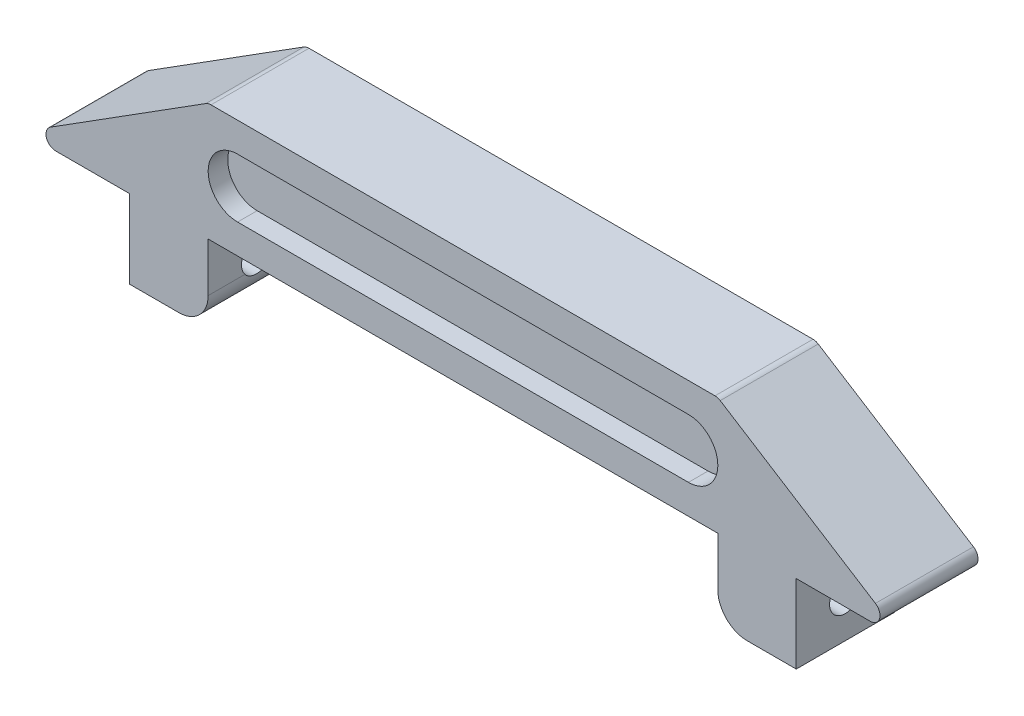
ISO-10303-21;
HEADER;
FILE_DESCRIPTION(('STEP AP214'),'2;1');
FILE_NAME('part.step','',(''),(''),'','','');
FILE_SCHEMA(('AUTOMOTIVE_DESIGN { 1 0 10303 214 1 1 1 1 }'));
ENDSEC;
DATA;
#1=APPLICATION_CONTEXT('core data for automotive mechanical design processes');
#2=APPLICATION_PROTOCOL_DEFINITION('international standard','automotive_design',2000,#1);
#3=PRODUCT_CONTEXT('',#1,'mechanical');
#4=PRODUCT('Part','Part','',(#3));
#5=PRODUCT_RELATED_PRODUCT_CATEGORY('part','',(#4));
#6=PRODUCT_DEFINITION_FORMATION('','',#4);
#7=PRODUCT_DEFINITION_CONTEXT('part definition',#1,'design');
#8=PRODUCT_DEFINITION('design','',#6,#7);
#9=PRODUCT_DEFINITION_SHAPE('','',#8);
#10=(LENGTH_UNIT() NAMED_UNIT(*) SI_UNIT(.MILLI.,.METRE.));
#11=(NAMED_UNIT(*) PLANE_ANGLE_UNIT() SI_UNIT($,.RADIAN.));
#12=(NAMED_UNIT(*) SI_UNIT($,.STERADIAN.) SOLID_ANGLE_UNIT());
#13=UNCERTAINTY_MEASURE_WITH_UNIT(LENGTH_MEASURE(1.E-05),#10,'distance_accuracy_value','');
#14=(GEOMETRIC_REPRESENTATION_CONTEXT(3) GLOBAL_UNCERTAINTY_ASSIGNED_CONTEXT((#13)) GLOBAL_UNIT_ASSIGNED_CONTEXT((#10,
#11,#12)) REPRESENTATION_CONTEXT('',''));
#15=CARTESIAN_POINT('',(0.,0.,0.));
#16=DIRECTION('',(0.,0.,1.));
#17=DIRECTION('',(1.,0.,0.));
#18=AXIS2_PLACEMENT_3D('',#15,#16,#17);
#19=CARTESIAN_POINT('',(0.,0.,3.));
#20=DIRECTION('',(0.,0.,1.));
#21=DIRECTION('',(1.,0.,0.));
#22=AXIS2_PLACEMENT_3D('',#19,#20,#21);
#23=PLANE('',#22);
#24=DIRECTION('',(1.,0.,0.));
#25=VECTOR('',#24,1.);
#26=CARTESIAN_POINT('',(23.,9.,3.));
#27=LINE('',#26,#25);
#28=CARTESIAN_POINT('',(23.,9.,3.));
#29=VERTEX_POINT('',#28);
#30=CARTESIAN_POINT('',(-23.,9.,3.));
#31=VERTEX_POINT('',#30);
#32=EDGE_CURVE('E177',#29,#31,#27,.F.);
#33=ORIENTED_EDGE('',*,*,#32,.T.);
#34=CARTESIAN_POINT('',(-23.,6.,3.));
#35=DIRECTION('',(0.,0.,1.));
#36=DIRECTION('',(1.,0.,0.));
#37=AXIS2_PLACEMENT_3D('',#34,#35,#36);
#38=CIRCLE('',#37,3.);
#39=CARTESIAN_POINT('',(-23.,3.,3.));
#40=VERTEX_POINT('',#39);
#41=EDGE_CURVE('E200',#31,#40,#38,.T.);
#42=ORIENTED_EDGE('',*,*,#41,.T.);
#43=DIRECTION('',(1.,0.,0.));
#44=VECTOR('',#43,1.);
#45=CARTESIAN_POINT('',(-23.,3.,3.));
#46=LINE('',#45,#44);
#47=CARTESIAN_POINT('',(23.,3.,3.));
#48=VERTEX_POINT('',#47);
#49=EDGE_CURVE('E193',#40,#48,#46,.T.);
#50=ORIENTED_EDGE('',*,*,#49,.T.);
#51=CARTESIAN_POINT('',(23.,6.,3.));
#52=DIRECTION('',(0.,0.,1.));
#53=DIRECTION('',(1.,0.,0.));
#54=AXIS2_PLACEMENT_3D('',#51,#52,#53);
#55=CIRCLE('',#54,3.);
#56=EDGE_CURVE('E20',#48,#29,#55,.T.);
#57=ORIENTED_EDGE('',*,*,#56,.T.);
#58=EDGE_LOOP('',(#33,#42,#50,#57));
#59=FACE_BOUND('',#58,.T.);
#60=ADVANCED_FACE('F16',(#59),#23,.T.);
#61=CARTESIAN_POINT('',(23.,9.,5.));
#62=DIRECTION('',(0.,1.,0.));
#63=DIRECTION('',(0.,0.,1.));
#64=AXIS2_PLACEMENT_3D('',#61,#62,#63);
#65=PLANE('',#64);
#66=ORIENTED_EDGE('',*,*,#32,.F.);
#67=DIRECTION('',(0.,0.,1.));
#68=VECTOR('',#67,1.);
#69=CARTESIAN_POINT('',(23.,9.,5.));
#70=LINE('',#69,#68);
#71=CARTESIAN_POINT('',(23.,9.,5.));
#72=VERTEX_POINT('',#71);
#73=EDGE_CURVE('E187',#29,#72,#70,.T.);
#74=ORIENTED_EDGE('',*,*,#73,.T.);
#75=DIRECTION('',(1.,0.,0.));
#76=VECTOR('',#75,1.);
#77=CARTESIAN_POINT('',(0.,9.,5.));
#78=LINE('',#77,#76);
#79=CARTESIAN_POINT('',(-23.,9.,5.));
#80=VERTEX_POINT('',#79);
#81=EDGE_CURVE('E467',#80,#72,#78,.T.);
#82=ORIENTED_EDGE('',*,*,#81,.F.);
#83=DIRECTION('',(0.,0.,1.));
#84=VECTOR('',#83,1.);
#85=CARTESIAN_POINT('',(-23.,9.,5.));
#86=LINE('',#85,#84);
#87=EDGE_CURVE('E197',#80,#31,#86,.F.);
#88=ORIENTED_EDGE('',*,*,#87,.T.);
#89=EDGE_LOOP('',(#66,#74,#82,#88));
#90=FACE_BOUND('',#89,.T.);
#91=ADVANCED_FACE('F626',(#90),#65,.F.);
#92=CARTESIAN_POINT('',(23.,6.,5.));
#93=DIRECTION('',(0.,0.,1.));
#94=DIRECTION('',(1.,0.,0.));
#95=AXIS2_PLACEMENT_3D('',#92,#93,#94);
#96=CYLINDRICAL_SURFACE('',#95,3.);
#97=ORIENTED_EDGE('',*,*,#56,.F.);
#98=DIRECTION('',(0.,0.,-1.));
#99=VECTOR('',#98,1.);
#100=CARTESIAN_POINT('',(23.,3.,5.));
#101=LINE('',#100,#99);
#102=CARTESIAN_POINT('',(23.,3.,5.));
#103=VERTEX_POINT('',#102);
#104=EDGE_CURVE('E185',#48,#103,#101,.F.);
#105=ORIENTED_EDGE('',*,*,#104,.T.);
#106=CARTESIAN_POINT('',(23.,6.,5.));
#107=DIRECTION('',(0.,0.,1.));
#108=DIRECTION('',(1.,0.,0.));
#109=AXIS2_PLACEMENT_3D('',#106,#107,#108);
#110=CIRCLE('',#109,3.);
#111=EDGE_CURVE('E468',#72,#103,#110,.F.);
#112=ORIENTED_EDGE('',*,*,#111,.F.);
#113=ORIENTED_EDGE('',*,*,#73,.F.);
#114=EDGE_LOOP('',(#97,#105,#112,#113));
#115=FACE_BOUND('',#114,.T.);
#116=ADVANCED_FACE('F184',(#115),#96,.F.);
#117=CARTESIAN_POINT('',(-23.,3.,5.));
#118=DIRECTION('',(0.,-1.,0.));
#119=DIRECTION('',(0.,0.,-1.));
#120=AXIS2_PLACEMENT_3D('',#117,#118,#119);
#121=PLANE('',#120);
#122=ORIENTED_EDGE('',*,*,#49,.F.);
#123=DIRECTION('',(0.,0.,1.));
#124=VECTOR('',#123,1.);
#125=CARTESIAN_POINT('',(-23.,3.,5.));
#126=LINE('',#125,#124);
#127=CARTESIAN_POINT('',(-23.,3.,5.));
#128=VERTEX_POINT('',#127);
#129=EDGE_CURVE('E461',#40,#128,#126,.T.);
#130=ORIENTED_EDGE('',*,*,#129,.T.);
#131=DIRECTION('',(1.,0.,0.));
#132=VECTOR('',#131,1.);
#133=CARTESIAN_POINT('',(0.,3.,5.));
#134=LINE('',#133,#132);
#135=EDGE_CURVE('E196',#103,#128,#134,.F.);
#136=ORIENTED_EDGE('',*,*,#135,.F.);
#137=ORIENTED_EDGE('',*,*,#104,.F.);
#138=EDGE_LOOP('',(#122,#130,#136,#137));
#139=FACE_BOUND('',#138,.T.);
#140=ADVANCED_FACE('F191',(#139),#121,.F.);
#141=CARTESIAN_POINT('',(-23.,6.,5.));
#142=DIRECTION('',(0.,0.,1.));
#143=DIRECTION('',(1.,0.,0.));
#144=AXIS2_PLACEMENT_3D('',#141,#142,#143);
#145=CYLINDRICAL_SURFACE('',#144,3.);
#146=ORIENTED_EDGE('',*,*,#41,.F.);
#147=ORIENTED_EDGE('',*,*,#87,.F.);
#148=CARTESIAN_POINT('',(-23.,6.,5.));
#149=DIRECTION('',(0.,0.,1.));
#150=DIRECTION('',(1.,0.,0.));
#151=AXIS2_PLACEMENT_3D('',#148,#149,#150);
#152=CIRCLE('',#151,3.);
#153=EDGE_CURVE('E470',#128,#80,#152,.F.);
#154=ORIENTED_EDGE('',*,*,#153,.F.);
#155=ORIENTED_EDGE('',*,*,#129,.F.);
#156=EDGE_LOOP('',(#146,#147,#154,#155));
#157=FACE_BOUND('',#156,.T.);
#158=ADVANCED_FACE('F637',(#157),#145,.F.);
#159=CARTESIAN_POINT('',(-51.05300274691,-4.,0.));
#160=DIRECTION('',(1.,0.,0.));
#161=DIRECTION('',(0.,0.,-1.));
#162=AXIS2_PLACEMENT_3D('',#159,#160,#161);
#163=CYLINDRICAL_SURFACE('',#162,1.6);
#164=CARTESIAN_POINT('',(-26.,-4.,0.));
#165=DIRECTION('',(1.,0.,0.));
#166=DIRECTION('',(0.,0.,-1.));
#167=AXIS2_PLACEMENT_3D('',#164,#165,#166);
#168=CIRCLE('',#167,1.6);
#169=CARTESIAN_POINT('',(-26.,-4.99999999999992,1.24899959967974));
#170=VERTEX_POINT('',#169);
#171=CARTESIAN_POINT('',(-26.,-4.99999999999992,-1.24899959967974));
#172=VERTEX_POINT('',#171);
#173=EDGE_CURVE('E439',#170,#172,#168,.F.);
#174=ORIENTED_EDGE('',*,*,#173,.F.);
#175=CARTESIAN_POINT('',(-26.,-4.99999999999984,-1.2489995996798));
#176=CARTESIAN_POINT('',(-25.999999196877,-5.03491914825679,-1.22104267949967));
#177=CARTESIAN_POINT('',(-26.0006097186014,-5.06864299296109,-1.19163690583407));
#178=CARTESIAN_POINT('',(-26.0027959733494,-5.13348742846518,-1.13013431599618));
#179=CARTESIAN_POINT('',(-26.004371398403,-5.16460884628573,-1.09803836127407));
#180=CARTESIAN_POINT('',(-26.010153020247,-5.25367823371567,-0.998114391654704));
#181=CARTESIAN_POINT('',(-26.0154163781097,-5.30745584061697,-0.926550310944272));
#182=CARTESIAN_POINT('',(-26.0267091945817,-5.40228516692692,-0.775596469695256));
#183=CARTESIAN_POINT('',(-26.0327383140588,-5.44334249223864,-0.696210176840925));
#184=CARTESIAN_POINT('',(-26.0437603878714,-5.51171372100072,-0.531650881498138));
#185=CARTESIAN_POINT('',(-26.0487534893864,-5.53902957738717,-0.446478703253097));
#186=CARTESIAN_POINT('',(-26.0563902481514,-5.57930392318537,-0.27185051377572));
#187=CARTESIAN_POINT('',(-26.0590114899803,-5.59212571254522,-0.182361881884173));
#188=CARTESIAN_POINT('',(-26.0611251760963,-5.6025320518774,-0.00246714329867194));
#189=CARTESIAN_POINT('',(-26.060617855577,-5.60011774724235,0.0879388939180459));
#190=CARTESIAN_POINT('',(-26.0566501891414,-5.58033342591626,0.26523707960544));
#191=CARTESIAN_POINT('',(-26.0532474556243,-5.56325513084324,0.352163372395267));
#192=CARTESIAN_POINT('',(-26.0444413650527,-5.51504108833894,0.521960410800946));
#193=CARTESIAN_POINT('',(-26.0390369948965,-5.48389822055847,0.604829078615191));
#194=CARTESIAN_POINT('',(-26.0276193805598,-5.40797260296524,0.765238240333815));
#195=CARTESIAN_POINT('',(-26.0215995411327,-5.36302885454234,0.842701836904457));
#196=CARTESIAN_POINT('',(-26.0109232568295,-5.2608428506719,0.989045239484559));
#197=CARTESIAN_POINT('',(-26.0062645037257,-5.20362170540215,1.05793946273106));
#198=CARTESIAN_POINT('',(-26.0022727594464,-5.11886244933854,1.14418472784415));
#199=CARTESIAN_POINT('',(-26.0014423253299,-5.09595284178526,1.16614592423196));
#200=CARTESIAN_POINT('',(-26.0003063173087,-5.04889418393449,1.20864485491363));
#201=CARTESIAN_POINT('',(-26.0000000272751,-5.02474687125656,1.22918449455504));
#202=CARTESIAN_POINT('',(-26.,-4.99999999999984,1.2489995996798));
#203=B_SPLINE_CURVE_WITH_KNOTS('',3,(#175,#176,#177,#178,#179,#180,#181,#182,#183,#184,#185,
#186,#187,#188,#189,#190,#191,#192,#193,#194,#195,#196,#197,#198,#199,#200,#201,#202),
.UNSPECIFIED.,.F.,.F.,(4,2,2,2,2,2,2,2,2,2,2,2,2,4),(0.,0.134100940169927,0.268159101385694,
0.53580268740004,0.803328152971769,1.07081558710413,1.34080529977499,1.61077471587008,
1.87549466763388,2.14034878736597,2.40841824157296,2.67603040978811,2.77122310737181,
2.866285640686),.UNSPECIFIED.);
#204=EDGE_CURVE('E393',#172,#170,#203,.T.);
#205=ORIENTED_EDGE('',*,*,#204,.F.);
#206=EDGE_LOOP('',(#174,#205));
#207=FACE_BOUND('',#206,.T.);
#208=CARTESIAN_POINT('',(-34.,-4.,0.));
#209=DIRECTION('',(1.,0.,0.));
#210=DIRECTION('',(0.,0.,-1.));
#211=AXIS2_PLACEMENT_3D('',#208,#209,#210);
#212=CIRCLE('',#211,1.6);
#213=CARTESIAN_POINT('',(-34.,-4.,-1.6));
#214=VERTEX_POINT('',#213);
#215=EDGE_CURVE('E409',#214,#214,#212,.T.);
#216=ORIENTED_EDGE('',*,*,#215,.F.);
#217=EDGE_LOOP('',(#216));
#218=FACE_BOUND('',#217,.T.);
#219=ADVANCED_FACE('F487',(#207,#218),#163,.F.);
#220=CARTESIAN_POINT('',(-51.05300274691,-4.,0.));
#221=DIRECTION('',(1.,0.,0.));
#222=DIRECTION('',(0.,0.,-1.));
#223=AXIS2_PLACEMENT_3D('',#220,#221,#222);
#224=CYLINDRICAL_SURFACE('',#223,1.6);
#225=CARTESIAN_POINT('',(34.,-4.,0.));
#226=DIRECTION('',(1.,0.,0.));
#227=DIRECTION('',(0.,0.,-1.));
#228=AXIS2_PLACEMENT_3D('',#225,#226,#227);
#229=CIRCLE('',#228,1.6);
#230=CARTESIAN_POINT('',(34.,-4.,-1.6));
#231=VERTEX_POINT('',#230);
#232=EDGE_CURVE('E244',#231,#231,#229,.F.);
#233=ORIENTED_EDGE('',*,*,#232,.F.);
#234=EDGE_LOOP('',(#233));
#235=FACE_BOUND('',#234,.T.);
#236=CARTESIAN_POINT('',(26.,-4.99999999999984,1.2489995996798));
#237=CARTESIAN_POINT('',(25.999999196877,-5.03491914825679,1.22104267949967));
#238=CARTESIAN_POINT('',(26.0006097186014,-5.06864299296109,1.19163690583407));
#239=CARTESIAN_POINT('',(26.0027959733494,-5.13348742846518,1.13013431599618));
#240=CARTESIAN_POINT('',(26.004371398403,-5.16460884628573,1.09803836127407));
#241=CARTESIAN_POINT('',(26.010153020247,-5.25367823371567,0.998114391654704));
#242=CARTESIAN_POINT('',(26.0154163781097,-5.30745584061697,0.926550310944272));
#243=CARTESIAN_POINT('',(26.0267091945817,-5.40228516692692,0.775596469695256));
#244=CARTESIAN_POINT('',(26.0327383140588,-5.44334249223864,0.696210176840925));
#245=CARTESIAN_POINT('',(26.0437603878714,-5.51171372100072,0.531650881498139));
#246=CARTESIAN_POINT('',(26.0487534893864,-5.53902957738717,0.446478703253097));
#247=CARTESIAN_POINT('',(26.0563902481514,-5.57930392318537,0.27185051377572));
#248=CARTESIAN_POINT('',(26.0590114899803,-5.59212571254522,0.182361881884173));
#249=CARTESIAN_POINT('',(26.0611251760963,-5.6025320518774,0.00246714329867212));
#250=CARTESIAN_POINT('',(26.060617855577,-5.60011774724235,-0.0879388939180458));
#251=CARTESIAN_POINT('',(26.0566501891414,-5.58033342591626,-0.26523707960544));
#252=CARTESIAN_POINT('',(26.0532474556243,-5.56325513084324,-0.352163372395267));
#253=CARTESIAN_POINT('',(26.0444413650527,-5.51504108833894,-0.521960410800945));
#254=CARTESIAN_POINT('',(26.0390369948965,-5.48389822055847,-0.60482907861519));
#255=CARTESIAN_POINT('',(26.0276193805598,-5.40797260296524,-0.765238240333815));
#256=CARTESIAN_POINT('',(26.0215995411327,-5.36302885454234,-0.842701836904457));
#257=CARTESIAN_POINT('',(26.0109232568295,-5.2608428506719,-0.989045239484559));
#258=CARTESIAN_POINT('',(26.0062645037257,-5.20362170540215,-1.05793946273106));
#259=CARTESIAN_POINT('',(26.0022727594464,-5.11886244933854,-1.14418472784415));
#260=CARTESIAN_POINT('',(26.0014423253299,-5.09595284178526,-1.16614592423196));
#261=CARTESIAN_POINT('',(26.0003063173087,-5.04889418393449,-1.20864485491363));
#262=CARTESIAN_POINT('',(26.0000000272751,-5.02474687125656,-1.22918449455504));
#263=CARTESIAN_POINT('',(26.,-4.99999999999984,-1.2489995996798));
#264=B_SPLINE_CURVE_WITH_KNOTS('',3,(#236,#237,#238,#239,#240,#241,#242,#243,#244,#245,#246,
#247,#248,#249,#250,#251,#252,#253,#254,#255,#256,#257,#258,#259,#260,#261,#262,#263),
.UNSPECIFIED.,.F.,.F.,(4,2,2,2,2,2,2,2,2,2,2,2,2,4),(0.,0.134100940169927,0.268159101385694,
0.53580268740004,0.803328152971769,1.07081558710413,1.34080529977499,1.61077471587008,
1.87549466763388,2.14034878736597,2.40841824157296,2.67603040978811,2.77122310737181,
2.866285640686),.UNSPECIFIED.);
#265=CARTESIAN_POINT('',(26.,-5.,1.24899959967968));
#266=VERTEX_POINT('',#265);
#267=CARTESIAN_POINT('',(26.,-4.99999999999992,-1.24899959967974));
#268=VERTEX_POINT('',#267);
#269=EDGE_CURVE('E249',#266,#268,#264,.T.);
#270=ORIENTED_EDGE('',*,*,#269,.F.);
#271=CARTESIAN_POINT('',(26.,-4.,0.));
#272=DIRECTION('',(1.,0.,0.));
#273=DIRECTION('',(0.,0.,-1.));
#274=AXIS2_PLACEMENT_3D('',#271,#272,#273);
#275=CIRCLE('',#274,1.6);
#276=EDGE_CURVE('E376',#268,#266,#275,.T.);
#277=ORIENTED_EDGE('',*,*,#276,.F.);
#278=EDGE_LOOP('',(#270,#277));
#279=FACE_BOUND('',#278,.T.);
#280=ADVANCED_FACE('F261',(#235,#279),#224,.F.);
#281=CARTESIAN_POINT('',(25.71064957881,11.,18.036));
#282=DIRECTION('',(0.,0.,-1.));
#283=DIRECTION('',(-1.,0.,0.));
#284=AXIS2_PLACEMENT_3D('',#281,#282,#283);
#285=CYLINDRICAL_SURFACE('',#284,1.);
#286=DIRECTION('',(0.,0.,1.));
#287=VECTOR('',#286,1.);
#288=CARTESIAN_POINT('',(26.2446425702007,11.8454889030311,-5.));
#289=LINE('',#288,#287);
#290=CARTESIAN_POINT('',(26.2446425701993,11.8454889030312,-5.));
#291=VERTEX_POINT('',#290);
#292=CARTESIAN_POINT('',(26.2446425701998,11.8454889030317,5.));
#293=VERTEX_POINT('',#292);
#294=EDGE_CURVE('E352',#291,#293,#289,.T.);
#295=ORIENTED_EDGE('',*,*,#294,.F.);
#296=CARTESIAN_POINT('',(25.71064957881,11.,-5.));
#297=DIRECTION('',(0.,0.,-1.));
#298=DIRECTION('',(-1.,0.,0.));
#299=AXIS2_PLACEMENT_3D('',#296,#297,#298);
#300=CIRCLE('',#299,1.);
#301=CARTESIAN_POINT('',(25.71064957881,12.,-5.));
#302=VERTEX_POINT('',#301);
#303=EDGE_CURVE('E462',#291,#302,#300,.F.);
#304=ORIENTED_EDGE('',*,*,#303,.T.);
#305=DIRECTION('',(0.,0.,1.));
#306=VECTOR('',#305,1.);
#307=CARTESIAN_POINT('',(25.71064957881,12.,-5.));
#308=LINE('',#307,#306);
#309=CARTESIAN_POINT('',(25.71064957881,12.,5.));
#310=VERTEX_POINT('',#309);
#311=EDGE_CURVE('E343',#310,#302,#308,.F.);
#312=ORIENTED_EDGE('',*,*,#311,.F.);
#313=CARTESIAN_POINT('',(25.71064957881,11.,5.));
#314=DIRECTION('',(0.,0.,-1.));
#315=DIRECTION('',(-1.,0.,0.));
#316=AXIS2_PLACEMENT_3D('',#313,#314,#315);
#317=CIRCLE('',#316,1.);
#318=EDGE_CURVE('E463',#293,#310,#317,.F.);
#319=ORIENTED_EDGE('',*,*,#318,.F.);
#320=EDGE_LOOP('',(#295,#304,#312,#319));
#321=FACE_BOUND('',#320,.T.);
#322=ADVANCED_FACE('F594',(#321),#285,.T.);
#323=CARTESIAN_POINT('',(0.,0.,5.));
#324=DIRECTION('',(0.,0.,1.));
#325=DIRECTION('',(1.,0.,0.));
#326=AXIS2_PLACEMENT_3D('',#323,#324,#325);
#327=PLANE('',#326);
#328=ORIENTED_EDGE('',*,*,#135,.T.);
#329=ORIENTED_EDGE('',*,*,#153,.T.);
#330=ORIENTED_EDGE('',*,*,#81,.T.);
#331=ORIENTED_EDGE('',*,*,#111,.T.);
#332=EDGE_LOOP('',(#328,#329,#330,#331));
#333=FACE_BOUND('',#332,.T.);
#334=DIRECTION('',(-0.845488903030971,-0.533992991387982,0.));
#335=VECTOR('',#334,1.);
#336=CARTESIAN_POINT('',(-26.,12.,5.));
#337=LINE('',#336,#335);
#338=CARTESIAN_POINT('',(-42.0779759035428,1.8454889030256,5.));
#339=VERTEX_POINT('',#338);
#340=CARTESIAN_POINT('',(-26.2446425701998,11.8454889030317,5.));
#341=VERTEX_POINT('',#340);
#342=EDGE_CURVE('E340',#339,#341,#337,.F.);
#343=ORIENTED_EDGE('',*,*,#342,.F.);
#344=CARTESIAN_POINT('',(-41.54398291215,1.,5.));
#345=DIRECTION('',(0.,0.,-1.));
#346=DIRECTION('',(-1.,0.,0.));
#347=AXIS2_PLACEMENT_3D('',#344,#345,#346);
#348=CIRCLE('',#347,1.);
#349=CARTESIAN_POINT('',(-41.54398291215,0.,5.));
#350=VERTEX_POINT('',#349);
#351=EDGE_CURVE('E457',#350,#339,#348,.T.);
#352=ORIENTED_EDGE('',*,*,#351,.F.);
#353=DIRECTION('',(1.,0.,0.));
#354=VECTOR('',#353,1.);
#355=CARTESIAN_POINT('',(-45.,0.,5.));
#356=LINE('',#355,#354);
#357=CARTESIAN_POINT('',(-34.,0.,5.));
#358=VERTEX_POINT('',#357);
#359=EDGE_CURVE('E415',#358,#350,#356,.F.);
#360=ORIENTED_EDGE('',*,*,#359,.F.);
#361=DIRECTION('',(0.,1.,0.));
#362=VECTOR('',#361,1.);
#363=CARTESIAN_POINT('',(-34.,0.,5.));
#364=LINE('',#363,#362);
#365=CARTESIAN_POINT('',(-34.,-8.,5.));
#366=VERTEX_POINT('',#365);
#367=EDGE_CURVE('E410',#366,#358,#364,.T.);
#368=ORIENTED_EDGE('',*,*,#367,.F.);
#369=DIRECTION('',(1.,0.,0.));
#370=VECTOR('',#369,1.);
#371=CARTESIAN_POINT('',(-34.,-8.,5.));
#372=LINE('',#371,#370);
#373=CARTESIAN_POINT('',(-29.,-8.,5.));
#374=VERTEX_POINT('',#373);
#375=EDGE_CURVE('E398',#374,#366,#372,.F.);
#376=ORIENTED_EDGE('',*,*,#375,.F.);
#377=CARTESIAN_POINT('',(-29.,-5.,5.));
#378=DIRECTION('',(0.,0.,1.));
#379=DIRECTION('',(1.,0.,0.));
#380=AXIS2_PLACEMENT_3D('',#377,#378,#379);
#381=CIRCLE('',#380,3.);
#382=CARTESIAN_POINT('',(-26.,-5.,5.));
#383=VERTEX_POINT('',#382);
#384=EDGE_CURVE('E394',#383,#374,#381,.F.);
#385=ORIENTED_EDGE('',*,*,#384,.F.);
#386=DIRECTION('',(0.,1.,0.));
#387=VECTOR('',#386,1.);
#388=CARTESIAN_POINT('',(-26.,-5.,5.));
#389=LINE('',#388,#387);
#390=CARTESIAN_POINT('',(-26.,0.,5.));
#391=VERTEX_POINT('',#390);
#392=EDGE_CURVE('E442',#391,#383,#389,.F.);
#393=ORIENTED_EDGE('',*,*,#392,.F.);
#394=DIRECTION('',(1.,0.,0.));
#395=VECTOR('',#394,1.);
#396=CARTESIAN_POINT('',(-26.,0.,5.));
#397=LINE('',#396,#395);
#398=CARTESIAN_POINT('',(26.,0.,5.));
#399=VERTEX_POINT('',#398);
#400=EDGE_CURVE('E388',#399,#391,#397,.F.);
#401=ORIENTED_EDGE('',*,*,#400,.F.);
#402=DIRECTION('',(0.,1.,0.));
#403=VECTOR('',#402,1.);
#404=CARTESIAN_POINT('',(26.,0.,5.));
#405=LINE('',#404,#403);
#406=CARTESIAN_POINT('',(26.,-5.,5.));
#407=VERTEX_POINT('',#406);
#408=EDGE_CURVE('E377',#407,#399,#405,.T.);
#409=ORIENTED_EDGE('',*,*,#408,.F.);
#410=CARTESIAN_POINT('',(29.,-5.,5.));
#411=DIRECTION('',(0.,0.,1.));
#412=DIRECTION('',(1.,0.,0.));
#413=AXIS2_PLACEMENT_3D('',#410,#411,#412);
#414=CIRCLE('',#413,3.);
#415=CARTESIAN_POINT('',(29.,-8.,5.));
#416=VERTEX_POINT('',#415);
#417=EDGE_CURVE('E259',#416,#407,#414,.F.);
#418=ORIENTED_EDGE('',*,*,#417,.F.);
#419=DIRECTION('',(1.,0.,0.));
#420=VECTOR('',#419,1.);
#421=CARTESIAN_POINT('',(29.,-8.,5.));
#422=LINE('',#421,#420);
#423=CARTESIAN_POINT('',(34.,-8.,5.));
#424=VERTEX_POINT('',#423);
#425=EDGE_CURVE('E257',#424,#416,#422,.F.);
#426=ORIENTED_EDGE('',*,*,#425,.F.);
#427=DIRECTION('',(0.,1.,0.));
#428=VECTOR('',#427,1.);
#429=CARTESIAN_POINT('',(34.,-8.,5.));
#430=LINE('',#429,#428);
#431=CARTESIAN_POINT('',(34.,0.,5.));
#432=VERTEX_POINT('',#431);
#433=EDGE_CURVE('E368',#432,#424,#430,.F.);
#434=ORIENTED_EDGE('',*,*,#433,.F.);
#435=DIRECTION('',(1.,0.,0.));
#436=VECTOR('',#435,1.);
#437=CARTESIAN_POINT('',(34.,0.,5.));
#438=LINE('',#437,#436);
#439=CARTESIAN_POINT('',(41.54398291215,0.,5.));
#440=VERTEX_POINT('',#439);
#441=EDGE_CURVE('E247',#440,#432,#438,.F.);
#442=ORIENTED_EDGE('',*,*,#441,.F.);
#443=CARTESIAN_POINT('',(41.54398291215,1.,5.));
#444=DIRECTION('',(0.,0.,-1.));
#445=DIRECTION('',(-1.,0.,0.));
#446=AXIS2_PLACEMENT_3D('',#443,#444,#445);
#447=CIRCLE('',#446,1.);
#448=CARTESIAN_POINT('',(42.0779759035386,1.84548890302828,5.));
#449=VERTEX_POINT('',#448);
#450=EDGE_CURVE('E240',#449,#440,#447,.T.);
#451=ORIENTED_EDGE('',*,*,#450,.F.);
#452=DIRECTION('',(-0.845488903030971,0.533992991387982,0.));
#453=VECTOR('',#452,1.);
#454=CARTESIAN_POINT('',(45.,0.,5.));
#455=LINE('',#454,#453);
#456=EDGE_CURVE('E353',#293,#449,#455,.F.);
#457=ORIENTED_EDGE('',*,*,#456,.F.);
#458=ORIENTED_EDGE('',*,*,#318,.T.);
#459=DIRECTION('',(1.,0.,0.));
#460=VECTOR('',#459,1.);
#461=CARTESIAN_POINT('',(26.,12.,5.));
#462=LINE('',#461,#460);
#463=CARTESIAN_POINT('',(-25.71064957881,12.,5.));
#464=VERTEX_POINT('',#463);
#465=EDGE_CURVE('E347',#464,#310,#462,.T.);
#466=ORIENTED_EDGE('',*,*,#465,.F.);
#467=CARTESIAN_POINT('',(-25.71064957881,11.,5.));
#468=DIRECTION('',(0.,0.,-1.));
#469=DIRECTION('',(-1.,0.,0.));
#470=AXIS2_PLACEMENT_3D('',#467,#468,#469);
#471=CIRCLE('',#470,1.);
#472=EDGE_CURVE('E473',#341,#464,#471,.T.);
#473=ORIENTED_EDGE('',*,*,#472,.F.);
#474=EDGE_LOOP('',(#343,#352,#360,#368,#376,#385,#393,#401,#409,#418,#426,#434,#442,#451,#457,
#458,#466,#473));
#475=FACE_BOUND('',#474,.T.);
#476=ADVANCED_FACE('F583',(#333,#475),#327,.T.);
#477=CARTESIAN_POINT('',(-25.71064957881,11.,18.036));
#478=DIRECTION('',(0.,0.,-1.));
#479=DIRECTION('',(-1.,0.,0.));
#480=AXIS2_PLACEMENT_3D('',#477,#478,#479);
#481=CYLINDRICAL_SURFACE('',#480,1.);
#482=DIRECTION('',(0.,0.,1.));
#483=VECTOR('',#482,1.);
#484=CARTESIAN_POINT('',(-25.71064957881,12.,-5.));
#485=LINE('',#484,#483);
#486=CARTESIAN_POINT('',(-25.71064957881,12.,-5.));
#487=VERTEX_POINT('',#486);
#488=EDGE_CURVE('E346',#487,#464,#485,.T.);
#489=ORIENTED_EDGE('',*,*,#488,.F.);
#490=CARTESIAN_POINT('',(-25.71064957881,11.,-5.));
#491=DIRECTION('',(0.,0.,-1.));
#492=DIRECTION('',(-1.,0.,0.));
#493=AXIS2_PLACEMENT_3D('',#490,#491,#492);
#494=CIRCLE('',#493,1.);
#495=CARTESIAN_POINT('',(-26.2446425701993,11.8454889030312,-5.));
#496=VERTEX_POINT('',#495);
#497=EDGE_CURVE('E475',#487,#496,#494,.F.);
#498=ORIENTED_EDGE('',*,*,#497,.T.);
#499=DIRECTION('',(0.,0.,1.));
#500=VECTOR('',#499,1.);
#501=CARTESIAN_POINT('',(-26.2446425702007,11.8454889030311,-5.));
#502=LINE('',#501,#500);
#503=EDGE_CURVE('E337',#341,#496,#502,.F.);
#504=ORIENTED_EDGE('',*,*,#503,.F.);
#505=ORIENTED_EDGE('',*,*,#472,.T.);
#506=EDGE_LOOP('',(#489,#498,#504,#505));
#507=FACE_BOUND('',#506,.T.);
#508=ADVANCED_FACE('F588',(#507),#481,.T.);
#509=CARTESIAN_POINT('',(0.,0.,-3.));
#510=DIRECTION('',(0.,0.,1.));
#511=DIRECTION('',(1.,0.,0.));
#512=AXIS2_PLACEMENT_3D('',#509,#510,#511);
#513=PLANE('',#512);
#514=DIRECTION('',(1.,0.,0.));
#515=VECTOR('',#514,1.);
#516=CARTESIAN_POINT('',(23.,9.,-3.));
#517=LINE('',#516,#515);
#518=CARTESIAN_POINT('',(23.,9.,-3.));
#519=VERTEX_POINT('',#518);
#520=CARTESIAN_POINT('',(-23.,9.,-3.));
#521=VERTEX_POINT('',#520);
#522=EDGE_CURVE('E238',#519,#521,#517,.F.);
#523=ORIENTED_EDGE('',*,*,#522,.F.);
#524=CARTESIAN_POINT('',(23.,6.,-3.));
#525=DIRECTION('',(0.,0.,1.));
#526=DIRECTION('',(1.,0.,0.));
#527=AXIS2_PLACEMENT_3D('',#524,#525,#526);
#528=CIRCLE('',#527,3.);
#529=CARTESIAN_POINT('',(23.,3.,-3.));
#530=VERTEX_POINT('',#529);
#531=EDGE_CURVE('E230',#519,#530,#528,.F.);
#532=ORIENTED_EDGE('',*,*,#531,.T.);
#533=DIRECTION('',(1.,0.,0.));
#534=VECTOR('',#533,1.);
#535=CARTESIAN_POINT('',(-23.,3.,-3.));
#536=LINE('',#535,#534);
#537=CARTESIAN_POINT('',(-23.,3.,-3.));
#538=VERTEX_POINT('',#537);
#539=EDGE_CURVE('E233',#538,#530,#536,.T.);
#540=ORIENTED_EDGE('',*,*,#539,.F.);
#541=CARTESIAN_POINT('',(-23.,6.,-3.));
#542=DIRECTION('',(0.,0.,1.));
#543=DIRECTION('',(1.,0.,0.));
#544=AXIS2_PLACEMENT_3D('',#541,#542,#543);
#545=CIRCLE('',#544,3.);
#546=EDGE_CURVE('E235',#538,#521,#545,.F.);
#547=ORIENTED_EDGE('',*,*,#546,.T.);
#548=EDGE_LOOP('',(#523,#532,#540,#547));
#549=FACE_BOUND('',#548,.T.);
#550=ADVANCED_FACE('F661',(#549),#513,.F.);
#551=CARTESIAN_POINT('',(-41.54398291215,1.,18.036));
#552=DIRECTION('',(0.,0.,-1.));
#553=DIRECTION('',(-1.,0.,0.));
#554=AXIS2_PLACEMENT_3D('',#551,#552,#553);
#555=CYLINDRICAL_SURFACE('',#554,1.);
#556=DIRECTION('',(0.,0.,1.));
#557=VECTOR('',#556,1.);
#558=CARTESIAN_POINT('',(-42.0779759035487,1.8454889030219,-5.));
#559=LINE('',#558,#557);
#560=CARTESIAN_POINT('',(-42.0779759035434,1.84548890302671,-5.));
#561=VERTEX_POINT('',#560);
#562=EDGE_CURVE('E239',#561,#339,#559,.T.);
#563=ORIENTED_EDGE('',*,*,#562,.F.);
#564=CARTESIAN_POINT('',(-41.54398291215,1.,-5.));
#565=DIRECTION('',(0.,0.,-1.));
#566=DIRECTION('',(-1.,0.,0.));
#567=AXIS2_PLACEMENT_3D('',#564,#565,#566);
#568=CIRCLE('',#567,1.);
#569=CARTESIAN_POINT('',(-41.54398291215,0.,-5.));
#570=VERTEX_POINT('',#569);
#571=EDGE_CURVE('E225',#561,#570,#568,.F.);
#572=ORIENTED_EDGE('',*,*,#571,.T.);
#573=DIRECTION('',(0.,0.,-1.));
#574=VECTOR('',#573,1.);
#575=CARTESIAN_POINT('',(-41.54398291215,0.,-5.));
#576=LINE('',#575,#574);
#577=EDGE_CURVE('E413',#350,#570,#576,.T.);
#578=ORIENTED_EDGE('',*,*,#577,.F.);
#579=ORIENTED_EDGE('',*,*,#351,.T.);
#580=EDGE_LOOP('',(#563,#572,#578,#579));
#581=FACE_BOUND('',#580,.T.);
#582=ADVANCED_FACE('F546',(#581),#555,.T.);
#583=CARTESIAN_POINT('',(-45.,0.,-5.));
#584=DIRECTION('',(0.,-1.,0.));
#585=DIRECTION('',(0.,0.,-1.));
#586=AXIS2_PLACEMENT_3D('',#583,#584,#585);
#587=PLANE('',#586);
#588=ORIENTED_EDGE('',*,*,#359,.T.);
#589=ORIENTED_EDGE('',*,*,#577,.T.);
#590=DIRECTION('',(1.,0.,0.));
#591=VECTOR('',#590,1.);
#592=CARTESIAN_POINT('',(0.,0.,-5.));
#593=LINE('',#592,#591);
#594=CARTESIAN_POINT('',(-34.,0.,-5.));
#595=VERTEX_POINT('',#594);
#596=EDGE_CURVE('E228',#570,#595,#593,.T.);
#597=ORIENTED_EDGE('',*,*,#596,.T.);
#598=DIRECTION('',(0.,0.,1.));
#599=VECTOR('',#598,1.);
#600=CARTESIAN_POINT('',(-34.,0.,-5.));
#601=LINE('',#600,#599);
#602=EDGE_CURVE('E406',#358,#595,#601,.F.);
#603=ORIENTED_EDGE('',*,*,#602,.F.);
#604=EDGE_LOOP('',(#588,#589,#597,#603));
#605=FACE_BOUND('',#604,.T.);
#606=ADVANCED_FACE('F538',(#605),#587,.T.);
#607=CARTESIAN_POINT('',(-34.,0.,-5.));
#608=DIRECTION('',(-1.,0.,0.));
#609=DIRECTION('',(0.,0.,1.));
#610=AXIS2_PLACEMENT_3D('',#607,#608,#609);
#611=PLANE('',#610);
#612=ORIENTED_EDGE('',*,*,#215,.T.);
#613=EDGE_LOOP('',(#612));
#614=FACE_BOUND('',#613,.T.);
#615=ORIENTED_EDGE('',*,*,#602,.T.);
#616=DIRECTION('',(0.,1.,0.));
#617=VECTOR('',#616,1.);
#618=CARTESIAN_POINT('',(-34.,0.,-5.));
#619=LINE('',#618,#617);
#620=CARTESIAN_POINT('',(-34.,-8.,-5.));
#621=VERTEX_POINT('',#620);
#622=EDGE_CURVE('E401',#595,#621,#619,.F.);
#623=ORIENTED_EDGE('',*,*,#622,.T.);
#624=DIRECTION('',(0.,0.,-1.));
#625=VECTOR('',#624,1.);
#626=CARTESIAN_POINT('',(-34.,-8.,-5.));
#627=LINE('',#626,#625);
#628=EDGE_CURVE('E395',#366,#621,#627,.T.);
#629=ORIENTED_EDGE('',*,*,#628,.F.);
#630=ORIENTED_EDGE('',*,*,#367,.T.);
#631=EDGE_LOOP('',(#615,#623,#629,#630));
#632=FACE_BOUND('',#631,.T.);
#633=ADVANCED_FACE('F581',(#614,#632),#611,.T.);
#634=CARTESIAN_POINT('',(-34.,-8.,-5.));
#635=DIRECTION('',(0.,-1.,0.));
#636=DIRECTION('',(0.,0.,-1.));
#637=AXIS2_PLACEMENT_3D('',#634,#635,#636);
#638=PLANE('',#637);
#639=ORIENTED_EDGE('',*,*,#628,.T.);
#640=DIRECTION('',(1.,0.,0.));
#641=VECTOR('',#640,1.);
#642=CARTESIAN_POINT('',(0.,-8.,-5.));
#643=LINE('',#642,#641);
#644=CARTESIAN_POINT('',(-29.,-8.,-5.));
#645=VERTEX_POINT('',#644);
#646=EDGE_CURVE('E224',#621,#645,#643,.T.);
#647=ORIENTED_EDGE('',*,*,#646,.T.);
#648=DIRECTION('',(0.,0.,1.));
#649=VECTOR('',#648,1.);
#650=CARTESIAN_POINT('',(-29.,-8.,-5.));
#651=LINE('',#650,#649);
#652=EDGE_CURVE('E391',#374,#645,#651,.F.);
#653=ORIENTED_EDGE('',*,*,#652,.F.);
#654=ORIENTED_EDGE('',*,*,#375,.T.);
#655=EDGE_LOOP('',(#639,#647,#653,#654));
#656=FACE_BOUND('',#655,.T.);
#657=ADVANCED_FACE('F496',(#656),#638,.T.);
#658=CARTESIAN_POINT('',(-29.,-5.,-5.));
#659=DIRECTION('',(0.,0.,1.));
#660=DIRECTION('',(1.,0.,0.));
#661=AXIS2_PLACEMENT_3D('',#658,#659,#660);
#662=CYLINDRICAL_SURFACE('',#661,3.);
#663=DIRECTION('',(0.,0.,-1.));
#664=VECTOR('',#663,1.);
#665=CARTESIAN_POINT('',(-26.,-5.,-5.));
#666=LINE('',#665,#664);
#667=CARTESIAN_POINT('',(-26.,-5.,-5.));
#668=VERTEX_POINT('',#667);
#669=EDGE_CURVE('E445',#172,#668,#666,.T.);
#670=ORIENTED_EDGE('',*,*,#669,.F.);
#671=ORIENTED_EDGE('',*,*,#204,.T.);
#672=DIRECTION('',(0.,0.,-1.));
#673=VECTOR('',#672,1.);
#674=CARTESIAN_POINT('',(-26.,-5.,-5.));
#675=LINE('',#674,#673);
#676=EDGE_CURVE('E444',#383,#170,#675,.T.);
#677=ORIENTED_EDGE('',*,*,#676,.F.);
#678=ORIENTED_EDGE('',*,*,#384,.T.);
#679=ORIENTED_EDGE('',*,*,#652,.T.);
#680=CARTESIAN_POINT('',(-29.,-5.,-5.));
#681=DIRECTION('',(0.,0.,1.));
#682=DIRECTION('',(1.,0.,0.));
#683=AXIS2_PLACEMENT_3D('',#680,#681,#682);
#684=CIRCLE('',#683,3.);
#685=EDGE_CURVE('E220',#645,#668,#684,.T.);
#686=ORIENTED_EDGE('',*,*,#685,.T.);
#687=EDGE_LOOP('',(#670,#671,#677,#678,#679,#686));
#688=FACE_BOUND('',#687,.T.);
#689=ADVANCED_FACE('F490',(#688),#662,.T.);
#690=CARTESIAN_POINT('',(-26.,-5.,-5.));
#691=DIRECTION('',(1.,0.,0.));
#692=DIRECTION('',(0.,0.,-1.));
#693=AXIS2_PLACEMENT_3D('',#690,#691,#692);
#694=PLANE('',#693);
#695=ORIENTED_EDGE('',*,*,#676,.T.);
#696=ORIENTED_EDGE('',*,*,#173,.T.);
#697=ORIENTED_EDGE('',*,*,#669,.T.);
#698=DIRECTION('',(0.,1.,0.));
#699=VECTOR('',#698,1.);
#700=CARTESIAN_POINT('',(-26.,0.,-5.));
#701=LINE('',#700,#699);
#702=CARTESIAN_POINT('',(-26.,0.,-5.));
#703=VERTEX_POINT('',#702);
#704=EDGE_CURVE('E223',#668,#703,#701,.T.);
#705=ORIENTED_EDGE('',*,*,#704,.T.);
#706=DIRECTION('',(0.,0.,-1.));
#707=VECTOR('',#706,1.);
#708=CARTESIAN_POINT('',(-26.,0.,-5.));
#709=LINE('',#708,#707);
#710=EDGE_CURVE('E385',#391,#703,#709,.T.);
#711=ORIENTED_EDGE('',*,*,#710,.F.);
#712=ORIENTED_EDGE('',*,*,#392,.T.);
#713=EDGE_LOOP('',(#695,#696,#697,#705,#711,#712));
#714=FACE_BOUND('',#713,.T.);
#715=ADVANCED_FACE('F495',(#714),#694,.T.);
#716=CARTESIAN_POINT('',(-26.,0.,-5.));
#717=DIRECTION('',(0.,-1.,0.));
#718=DIRECTION('',(0.,0.,-1.));
#719=AXIS2_PLACEMENT_3D('',#716,#717,#718);
#720=PLANE('',#719);
#721=ORIENTED_EDGE('',*,*,#710,.T.);
#722=DIRECTION('',(1.,0.,0.));
#723=VECTOR('',#722,1.);
#724=CARTESIAN_POINT('',(0.,0.,-5.));
#725=LINE('',#724,#723);
#726=CARTESIAN_POINT('',(26.,0.,-5.));
#727=VERTEX_POINT('',#726);
#728=EDGE_CURVE('E380',#703,#727,#725,.T.);
#729=ORIENTED_EDGE('',*,*,#728,.T.);
#730=DIRECTION('',(0.,0.,1.));
#731=VECTOR('',#730,1.);
#732=CARTESIAN_POINT('',(26.,0.,-5.));
#733=LINE('',#732,#731);
#734=EDGE_CURVE('E373',#399,#727,#733,.F.);
#735=ORIENTED_EDGE('',*,*,#734,.F.);
#736=ORIENTED_EDGE('',*,*,#400,.T.);
#737=EDGE_LOOP('',(#721,#729,#735,#736));
#738=FACE_BOUND('',#737,.T.);
#739=ADVANCED_FACE('F500',(#738),#720,.T.);
#740=CARTESIAN_POINT('',(26.,0.,-5.));
#741=DIRECTION('',(-1.,0.,0.));
#742=DIRECTION('',(0.,0.,1.));
#743=AXIS2_PLACEMENT_3D('',#740,#741,#742);
#744=PLANE('',#743);
#745=DIRECTION('',(0.,0.,1.));
#746=VECTOR('',#745,1.);
#747=CARTESIAN_POINT('',(26.,-5.,-5.));
#748=LINE('',#747,#746);
#749=CARTESIAN_POINT('',(26.,-5.,-5.));
#750=VERTEX_POINT('',#749);
#751=EDGE_CURVE('E567',#268,#750,#748,.F.);
#752=ORIENTED_EDGE('',*,*,#751,.F.);
#753=ORIENTED_EDGE('',*,*,#276,.T.);
#754=DIRECTION('',(0.,0.,1.));
#755=VECTOR('',#754,1.);
#756=CARTESIAN_POINT('',(26.,-5.,-5.));
#757=LINE('',#756,#755);
#758=EDGE_CURVE('E258',#407,#266,#757,.F.);
#759=ORIENTED_EDGE('',*,*,#758,.F.);
#760=ORIENTED_EDGE('',*,*,#408,.T.);
#761=ORIENTED_EDGE('',*,*,#734,.T.);
#762=DIRECTION('',(0.,1.,0.));
#763=VECTOR('',#762,1.);
#764=CARTESIAN_POINT('',(26.,0.,-5.));
#765=LINE('',#764,#763);
#766=EDGE_CURVE('E219',#727,#750,#765,.F.);
#767=ORIENTED_EDGE('',*,*,#766,.T.);
#768=EDGE_LOOP('',(#752,#753,#759,#760,#761,#767));
#769=FACE_BOUND('',#768,.T.);
#770=ADVANCED_FACE('F271',(#769),#744,.T.);
#771=CARTESIAN_POINT('',(29.,-5.,-5.));
#772=DIRECTION('',(0.,0.,1.));
#773=DIRECTION('',(1.,0.,0.));
#774=AXIS2_PLACEMENT_3D('',#771,#772,#773);
#775=CYLINDRICAL_SURFACE('',#774,3.);
#776=ORIENTED_EDGE('',*,*,#758,.T.);
#777=ORIENTED_EDGE('',*,*,#269,.T.);
#778=ORIENTED_EDGE('',*,*,#751,.T.);
#779=CARTESIAN_POINT('',(29.,-5.,-5.));
#780=DIRECTION('',(0.,0.,1.));
#781=DIRECTION('',(1.,0.,0.));
#782=AXIS2_PLACEMENT_3D('',#779,#780,#781);
#783=CIRCLE('',#782,3.);
#784=CARTESIAN_POINT('',(29.,-8.,-5.));
#785=VERTEX_POINT('',#784);
#786=EDGE_CURVE('E215',#750,#785,#783,.T.);
#787=ORIENTED_EDGE('',*,*,#786,.T.);
#788=DIRECTION('',(0.,0.,-1.));
#789=VECTOR('',#788,1.);
#790=CARTESIAN_POINT('',(29.,-8.,-5.));
#791=LINE('',#790,#789);
#792=EDGE_CURVE('E371',#416,#785,#791,.T.);
#793=ORIENTED_EDGE('',*,*,#792,.F.);
#794=ORIENTED_EDGE('',*,*,#417,.T.);
#795=EDGE_LOOP('',(#776,#777,#778,#787,#793,#794));
#796=FACE_BOUND('',#795,.T.);
#797=ADVANCED_FACE('F265',(#796),#775,.T.);
#798=CARTESIAN_POINT('',(29.,-8.,-5.));
#799=DIRECTION('',(0.,-1.,0.));
#800=DIRECTION('',(0.,0.,-1.));
#801=AXIS2_PLACEMENT_3D('',#798,#799,#800);
#802=PLANE('',#801);
#803=ORIENTED_EDGE('',*,*,#792,.T.);
#804=DIRECTION('',(1.,0.,0.));
#805=VECTOR('',#804,1.);
#806=CARTESIAN_POINT('',(0.,-8.,-5.));
#807=LINE('',#806,#805);
#808=CARTESIAN_POINT('',(34.,-8.,-5.));
#809=VERTEX_POINT('',#808);
#810=EDGE_CURVE('E218',#785,#809,#807,.T.);
#811=ORIENTED_EDGE('',*,*,#810,.T.);
#812=DIRECTION('',(0.,0.,-1.));
#813=VECTOR('',#812,1.);
#814=CARTESIAN_POINT('',(34.,-8.,-5.));
#815=LINE('',#814,#813);
#816=EDGE_CURVE('E248',#424,#809,#815,.T.);
#817=ORIENTED_EDGE('',*,*,#816,.F.);
#818=ORIENTED_EDGE('',*,*,#425,.T.);
#819=EDGE_LOOP('',(#803,#811,#817,#818));
#820=FACE_BOUND('',#819,.T.);
#821=ADVANCED_FACE('F270',(#820),#802,.T.);
#822=CARTESIAN_POINT('',(34.,-8.,-5.));
#823=DIRECTION('',(1.,0.,0.));
#824=DIRECTION('',(0.,0.,-1.));
#825=AXIS2_PLACEMENT_3D('',#822,#823,#824);
#826=PLANE('',#825);
#827=ORIENTED_EDGE('',*,*,#232,.T.);
#828=EDGE_LOOP('',(#827));
#829=FACE_BOUND('',#828,.T.);
#830=ORIENTED_EDGE('',*,*,#816,.T.);
#831=DIRECTION('',(0.,1.,0.));
#832=VECTOR('',#831,1.);
#833=CARTESIAN_POINT('',(34.,0.,-5.));
#834=LINE('',#833,#832);
#835=CARTESIAN_POINT('',(34.,0.,-5.));
#836=VERTEX_POINT('',#835);
#837=EDGE_CURVE('E361',#809,#836,#834,.T.);
#838=ORIENTED_EDGE('',*,*,#837,.T.);
#839=DIRECTION('',(0.,0.,-1.));
#840=VECTOR('',#839,1.);
#841=CARTESIAN_POINT('',(34.,0.,-5.));
#842=LINE('',#841,#840);
#843=EDGE_CURVE('E243',#432,#836,#842,.T.);
#844=ORIENTED_EDGE('',*,*,#843,.F.);
#845=ORIENTED_EDGE('',*,*,#433,.T.);
#846=EDGE_LOOP('',(#830,#838,#844,#845));
#847=FACE_BOUND('',#846,.T.);
#848=ADVANCED_FACE('F276',(#829,#847),#826,.T.);
#849=CARTESIAN_POINT('',(34.,0.,-5.));
#850=DIRECTION('',(0.,-1.,0.));
#851=DIRECTION('',(0.,0.,-1.));
#852=AXIS2_PLACEMENT_3D('',#849,#850,#851);
#853=PLANE('',#852);
#854=DIRECTION('',(1.,0.,0.));
#855=VECTOR('',#854,1.);
#856=CARTESIAN_POINT('',(0.,0.,-5.));
#857=LINE('',#856,#855);
#858=CARTESIAN_POINT('',(41.54398291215,0.,-5.));
#859=VERTEX_POINT('',#858);
#860=EDGE_CURVE('E214',#836,#859,#857,.T.);
#861=ORIENTED_EDGE('',*,*,#860,.T.);
#862=DIRECTION('',(0.,0.,-1.));
#863=VECTOR('',#862,1.);
#864=CARTESIAN_POINT('',(41.54398291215,0.,18.036));
#865=LINE('',#864,#863);
#866=EDGE_CURVE('E242',#440,#859,#865,.T.);
#867=ORIENTED_EDGE('',*,*,#866,.F.);
#868=ORIENTED_EDGE('',*,*,#441,.T.);
#869=ORIENTED_EDGE('',*,*,#843,.T.);
#870=EDGE_LOOP('',(#861,#867,#868,#869));
#871=FACE_BOUND('',#870,.T.);
#872=ADVANCED_FACE('F280',(#871),#853,.T.);
#873=CARTESIAN_POINT('',(41.54398291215,1.,18.036));
#874=DIRECTION('',(0.,0.,-1.));
#875=DIRECTION('',(-1.,0.,0.));
#876=AXIS2_PLACEMENT_3D('',#873,#874,#875);
#877=CYLINDRICAL_SURFACE('',#876,1.);
#878=ORIENTED_EDGE('',*,*,#866,.T.);
#879=CARTESIAN_POINT('',(41.54398291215,1.,-5.));
#880=DIRECTION('',(0.,0.,-1.));
#881=DIRECTION('',(-1.,0.,0.));
#882=AXIS2_PLACEMENT_3D('',#879,#880,#881);
#883=CIRCLE('',#882,1.);
#884=CARTESIAN_POINT('',(42.077975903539,1.84548890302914,-5.));
#885=VERTEX_POINT('',#884);
#886=EDGE_CURVE('E210',#859,#885,#883,.F.);
#887=ORIENTED_EDGE('',*,*,#886,.T.);
#888=DIRECTION('',(0.,0.,1.));
#889=VECTOR('',#888,1.);
#890=CARTESIAN_POINT('',(42.0779759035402,1.84548890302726,-5.));
#891=LINE('',#890,#889);
#892=EDGE_CURVE('E350',#449,#885,#891,.F.);
#893=ORIENTED_EDGE('',*,*,#892,.F.);
#894=ORIENTED_EDGE('',*,*,#450,.T.);
#895=EDGE_LOOP('',(#878,#887,#893,#894));
#896=FACE_BOUND('',#895,.T.);
#897=ADVANCED_FACE('F284',(#896),#877,.T.);
#898=CARTESIAN_POINT('',(45.,0.,-5.));
#899=DIRECTION('',(0.533992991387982,0.845488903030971,0.));
#900=DIRECTION('',(-0.845488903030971,0.533992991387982,0.));
#901=AXIS2_PLACEMENT_3D('',#898,#899,#900);
#902=PLANE('',#901);
#903=DIRECTION('',(-0.845488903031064,0.533992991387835,0.));
#904=VECTOR('',#903,1.);
#905=CARTESIAN_POINT('',(42.07797590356,1.845488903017,-5.));
#906=LINE('',#905,#904);
#907=EDGE_CURVE('E213',#885,#291,#906,.T.);
#908=ORIENTED_EDGE('',*,*,#907,.T.);
#909=ORIENTED_EDGE('',*,*,#294,.T.);
#910=ORIENTED_EDGE('',*,*,#456,.T.);
#911=ORIENTED_EDGE('',*,*,#892,.T.);
#912=EDGE_LOOP('',(#908,#909,#910,#911));
#913=FACE_BOUND('',#912,.T.);
#914=ADVANCED_FACE('F288',(#913),#902,.T.);
#915=CARTESIAN_POINT('',(26.,12.,-5.));
#916=DIRECTION('',(0.,1.,0.));
#917=DIRECTION('',(0.,0.,1.));
#918=AXIS2_PLACEMENT_3D('',#915,#916,#917);
#919=PLANE('',#918);
#920=DIRECTION('',(1.,0.,0.));
#921=VECTOR('',#920,1.);
#922=CARTESIAN_POINT('',(0.,12.,-5.));
#923=LINE('',#922,#921);
#924=EDGE_CURVE('E551',#302,#487,#923,.F.);
#925=ORIENTED_EDGE('',*,*,#924,.T.);
#926=ORIENTED_EDGE('',*,*,#488,.T.);
#927=ORIENTED_EDGE('',*,*,#465,.T.);
#928=ORIENTED_EDGE('',*,*,#311,.T.);
#929=EDGE_LOOP('',(#925,#926,#927,#928));
#930=FACE_BOUND('',#929,.T.);
#931=ADVANCED_FACE('F292',(#930),#919,.T.);
#932=CARTESIAN_POINT('',(-26.,12.,-5.));
#933=DIRECTION('',(-0.533992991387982,0.845488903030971,0.));
#934=DIRECTION('',(-0.845488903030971,-0.533992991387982,0.));
#935=AXIS2_PLACEMENT_3D('',#932,#933,#934);
#936=PLANE('',#935);
#937=DIRECTION('',(-0.84548890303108,-0.533992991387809,0.));
#938=VECTOR('',#937,1.);
#939=CARTESIAN_POINT('',(-26.2446425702,11.84548890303,-5.));
#940=LINE('',#939,#938);
#941=EDGE_CURVE('E209',#496,#561,#940,.T.);
#942=ORIENTED_EDGE('',*,*,#941,.T.);
#943=ORIENTED_EDGE('',*,*,#562,.T.);
#944=ORIENTED_EDGE('',*,*,#342,.T.);
#945=ORIENTED_EDGE('',*,*,#503,.T.);
#946=EDGE_LOOP('',(#942,#943,#944,#945));
#947=FACE_BOUND('',#946,.T.);
#948=ADVANCED_FACE('F296',(#947),#936,.T.);
#949=CARTESIAN_POINT('',(-23.,6.,-5.));
#950=DIRECTION('',(0.,0.,1.));
#951=DIRECTION('',(1.,0.,0.));
#952=AXIS2_PLACEMENT_3D('',#949,#950,#951);
#953=CYLINDRICAL_SURFACE('',#952,3.);
#954=ORIENTED_EDGE('',*,*,#546,.F.);
#955=DIRECTION('',(0.,0.,1.));
#956=VECTOR('',#955,1.);
#957=CARTESIAN_POINT('',(-23.,3.,-5.));
#958=LINE('',#957,#956);
#959=CARTESIAN_POINT('',(-23.,3.,-5.));
#960=VERTEX_POINT('',#959);
#961=EDGE_CURVE('E229',#960,#538,#958,.T.);
#962=ORIENTED_EDGE('',*,*,#961,.F.);
#963=CARTESIAN_POINT('',(-23.,6.,-5.));
#964=DIRECTION('',(0.,0.,1.));
#965=DIRECTION('',(1.,0.,0.));
#966=AXIS2_PLACEMENT_3D('',#963,#964,#965);
#967=CIRCLE('',#966,3.);
#968=CARTESIAN_POINT('',(-23.,9.,-5.));
#969=VERTEX_POINT('',#968);
#970=EDGE_CURVE('E207',#960,#969,#967,.F.);
#971=ORIENTED_EDGE('',*,*,#970,.T.);
#972=DIRECTION('',(0.,0.,-1.));
#973=VECTOR('',#972,1.);
#974=CARTESIAN_POINT('',(-23.,9.,-5.));
#975=LINE('',#974,#973);
#976=EDGE_CURVE('E335',#521,#969,#975,.T.);
#977=ORIENTED_EDGE('',*,*,#976,.F.);
#978=EDGE_LOOP('',(#954,#962,#971,#977));
#979=FACE_BOUND('',#978,.T.);
#980=ADVANCED_FACE('F300',(#979),#953,.F.);
#981=CARTESIAN_POINT('',(23.,9.,-5.));
#982=DIRECTION('',(0.,-1.,0.));
#983=DIRECTION('',(0.,0.,-1.));
#984=AXIS2_PLACEMENT_3D('',#981,#982,#983);
#985=PLANE('',#984);
#986=ORIENTED_EDGE('',*,*,#522,.T.);
#987=ORIENTED_EDGE('',*,*,#976,.T.);
#988=DIRECTION('',(1.,0.,0.));
#989=VECTOR('',#988,1.);
#990=CARTESIAN_POINT('',(0.,9.,-5.));
#991=LINE('',#990,#989);
#992=CARTESIAN_POINT('',(23.,9.,-5.));
#993=VERTEX_POINT('',#992);
#994=EDGE_CURVE('E206',#969,#993,#991,.T.);
#995=ORIENTED_EDGE('',*,*,#994,.T.);
#996=DIRECTION('',(0.,0.,1.));
#997=VECTOR('',#996,1.);
#998=CARTESIAN_POINT('',(23.,9.,-5.));
#999=LINE('',#998,#997);
#1000=EDGE_CURVE('E234',#993,#519,#999,.T.);
#1001=ORIENTED_EDGE('',*,*,#1000,.T.);
#1002=EDGE_LOOP('',(#986,#987,#995,#1001));
#1003=FACE_BOUND('',#1002,.T.);
#1004=ADVANCED_FACE('F304',(#1003),#985,.T.);
#1005=CARTESIAN_POINT('',(23.,6.,-5.));
#1006=DIRECTION('',(0.,0.,1.));
#1007=DIRECTION('',(1.,0.,0.));
#1008=AXIS2_PLACEMENT_3D('',#1005,#1006,#1007);
#1009=CYLINDRICAL_SURFACE('',#1008,3.);
#1010=ORIENTED_EDGE('',*,*,#531,.F.);
#1011=ORIENTED_EDGE('',*,*,#1000,.F.);
#1012=CARTESIAN_POINT('',(23.,6.,-5.));
#1013=DIRECTION('',(0.,0.,1.));
#1014=DIRECTION('',(1.,0.,0.));
#1015=AXIS2_PLACEMENT_3D('',#1012,#1013,#1014);
#1016=CIRCLE('',#1015,3.);
#1017=CARTESIAN_POINT('',(23.,3.,-5.));
#1018=VERTEX_POINT('',#1017);
#1019=EDGE_CURVE('E26',#993,#1018,#1016,.F.);
#1020=ORIENTED_EDGE('',*,*,#1019,.T.);
#1021=DIRECTION('',(0.,0.,1.));
#1022=VECTOR('',#1021,1.);
#1023=CARTESIAN_POINT('',(23.,3.,-5.));
#1024=LINE('',#1023,#1022);
#1025=EDGE_CURVE('E323',#530,#1018,#1024,.F.);
#1026=ORIENTED_EDGE('',*,*,#1025,.F.);
#1027=EDGE_LOOP('',(#1010,#1011,#1020,#1026));
#1028=FACE_BOUND('',#1027,.T.);
#1029=ADVANCED_FACE('F308',(#1028),#1009,.F.);
#1030=CARTESIAN_POINT('',(-23.,3.,-5.));
#1031=DIRECTION('',(0.,1.,0.));
#1032=DIRECTION('',(0.,0.,1.));
#1033=AXIS2_PLACEMENT_3D('',#1030,#1031,#1032);
#1034=PLANE('',#1033);
#1035=DIRECTION('',(1.,0.,0.));
#1036=VECTOR('',#1035,1.);
#1037=CARTESIAN_POINT('',(0.,3.,-5.));
#1038=LINE('',#1037,#1036);
#1039=EDGE_CURVE('E11',#1018,#960,#1038,.F.);
#1040=ORIENTED_EDGE('',*,*,#1039,.T.);
#1041=ORIENTED_EDGE('',*,*,#961,.T.);
#1042=ORIENTED_EDGE('',*,*,#539,.T.);
#1043=ORIENTED_EDGE('',*,*,#1025,.T.);
#1044=EDGE_LOOP('',(#1040,#1041,#1042,#1043));
#1045=FACE_BOUND('',#1044,.T.);
#1046=ADVANCED_FACE('F311',(#1045),#1034,.T.);
#1047=CARTESIAN_POINT('',(0.,0.,-5.));
#1048=DIRECTION('',(0.,0.,1.));
#1049=DIRECTION('',(1.,0.,0.));
#1050=AXIS2_PLACEMENT_3D('',#1047,#1048,#1049);
#1051=PLANE('',#1050);
#1052=ORIENTED_EDGE('',*,*,#1039,.F.);
#1053=ORIENTED_EDGE('',*,*,#1019,.F.);
#1054=ORIENTED_EDGE('',*,*,#994,.F.);
#1055=ORIENTED_EDGE('',*,*,#970,.F.);
#1056=EDGE_LOOP('',(#1052,#1053,#1054,#1055));
#1057=FACE_BOUND('',#1056,.T.);
#1058=ORIENTED_EDGE('',*,*,#497,.F.);
#1059=ORIENTED_EDGE('',*,*,#924,.F.);
#1060=ORIENTED_EDGE('',*,*,#303,.F.);
#1061=ORIENTED_EDGE('',*,*,#907,.F.);
#1062=ORIENTED_EDGE('',*,*,#886,.F.);
#1063=ORIENTED_EDGE('',*,*,#860,.F.);
#1064=ORIENTED_EDGE('',*,*,#837,.F.);
#1065=ORIENTED_EDGE('',*,*,#810,.F.);
#1066=ORIENTED_EDGE('',*,*,#786,.F.);
#1067=ORIENTED_EDGE('',*,*,#766,.F.);
#1068=ORIENTED_EDGE('',*,*,#728,.F.);
#1069=ORIENTED_EDGE('',*,*,#704,.F.);
#1070=ORIENTED_EDGE('',*,*,#685,.F.);
#1071=ORIENTED_EDGE('',*,*,#646,.F.);
#1072=ORIENTED_EDGE('',*,*,#622,.F.);
#1073=ORIENTED_EDGE('',*,*,#596,.F.);
#1074=ORIENTED_EDGE('',*,*,#571,.F.);
#1075=ORIENTED_EDGE('',*,*,#941,.F.);
#1076=EDGE_LOOP('',(#1058,#1059,#1060,#1061,#1062,#1063,#1064,#1065,#1066,#1067,#1068,#1069,
#1070,#1071,#1072,#1073,#1074,#1075));
#1077=FACE_BOUND('',#1076,.T.);
#1078=ADVANCED_FACE('F18',(#1057,#1077),#1051,.F.);
#1079=CLOSED_SHELL('',(#60,#91,#116,#140,#158,#219,#280,#322,#476,#508,#550,#582,#606,#633,#657,
#689,#715,#739,#770,#797,#821,#848,#872,#897,#914,#931,#948,#980,#1004,#1029,#1046,#1078));
#1080=MANIFOLD_SOLID_BREP('B1',#1079);
#1081=ADVANCED_BREP_SHAPE_REPRESENTATION('',(#18,#1080),#14);
#1082=SHAPE_DEFINITION_REPRESENTATION(#9,#1081);
ENDSEC;
END-ISO-10303-21;
